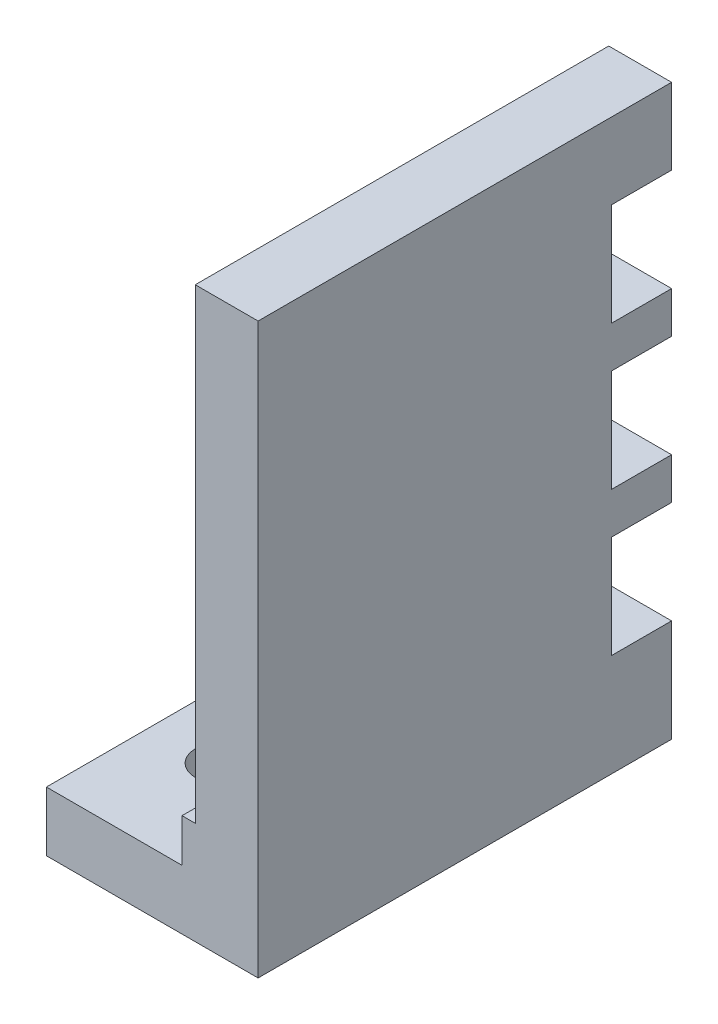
from build123d import *

# Parameters (mm, degrees)
BOSS_EXTRUDE1_DEPTH   = 31.75
F_6_CLEARANCE_HOLE1_D = 3.7973
CUT_EXTRUDE1_REACH    = 58.4
SKETCH5_W             = 4.6228
SKETCH5_H             = 7.874


with BuildPart() as part:
    # Sketch1 → Boss-Extrude1 (new body)
    with BuildSketch(Plane.XY):
        Polygon((0, 43.688), (0, 0), (-16.256, 0), (-16.256, 4.572), (-5.842, 4.572), (-5.842, 7.874), (-4.826, 7.874), (-4.826, 43.688), align=None)
    extrude(amount=BOSS_EXTRUDE1_DEPTH)

    # 6 Clearance Hole1 (through all)
    with Locations(Plane(origin=(0, 0, 0), x_dir=(-1, 0, 0), z_dir=(0, -1, 0))):
        with Locations((11.176, -23.495), (11.176, -7.62)):
            Hole(F_6_CLEARANCE_HOLE1_D / 2)

    # Sketch5 → Cut-Extrude1 (cut, up to next)
    with BuildSketch(Plane.ZY, mode=Mode.PRIVATE) as cut_extrude1_sk1:
        with Locations((2.3114, 33.909)):
            Rectangle(SKETCH5_W, SKETCH5_H)
    cut_extrude1_tool1 = extrude(cut_extrude1_sk1.sketch, amount=CUT_EXTRUDE1_REACH, mode=Mode.PRIVATE) & part.part
    # Sketch5 → Cut-Extrude1 (cut, up to next)
    with BuildSketch(Plane.ZY, mode=Mode.PRIVATE) as cut_extrude1_sk2:
        with Locations((2.3114, 22.86)):
            Rectangle(SKETCH5_W, SKETCH5_H)
    cut_extrude1_tool2 = extrude(cut_extrude1_sk2.sketch, amount=CUT_EXTRUDE1_REACH, mode=Mode.PRIVATE) & part.part
    # Sketch5 → Cut-Extrude1 (cut, up to next)
    with BuildSketch(Plane.ZY, mode=Mode.PRIVATE) as cut_extrude1_sk3:
        with Locations((2.3114, 11.811)):
            Rectangle(SKETCH5_W, SKETCH5_H)
    cut_extrude1_tool3 = extrude(cut_extrude1_sk3.sketch, amount=CUT_EXTRUDE1_REACH, mode=Mode.PRIVATE) & part.part
    add(cut_extrude1_tool1.solids().sort_by_distance((0, 33.909, 2.3114))[0], mode=Mode.SUBTRACT)
    add(cut_extrude1_tool2.solids().sort_by_distance((0, 22.86, 2.3114))[0], mode=Mode.SUBTRACT)
    add(cut_extrude1_tool3.solids().sort_by_distance((0, 11.811, 2.3114))[0], mode=Mode.SUBTRACT)


solid = part.part
